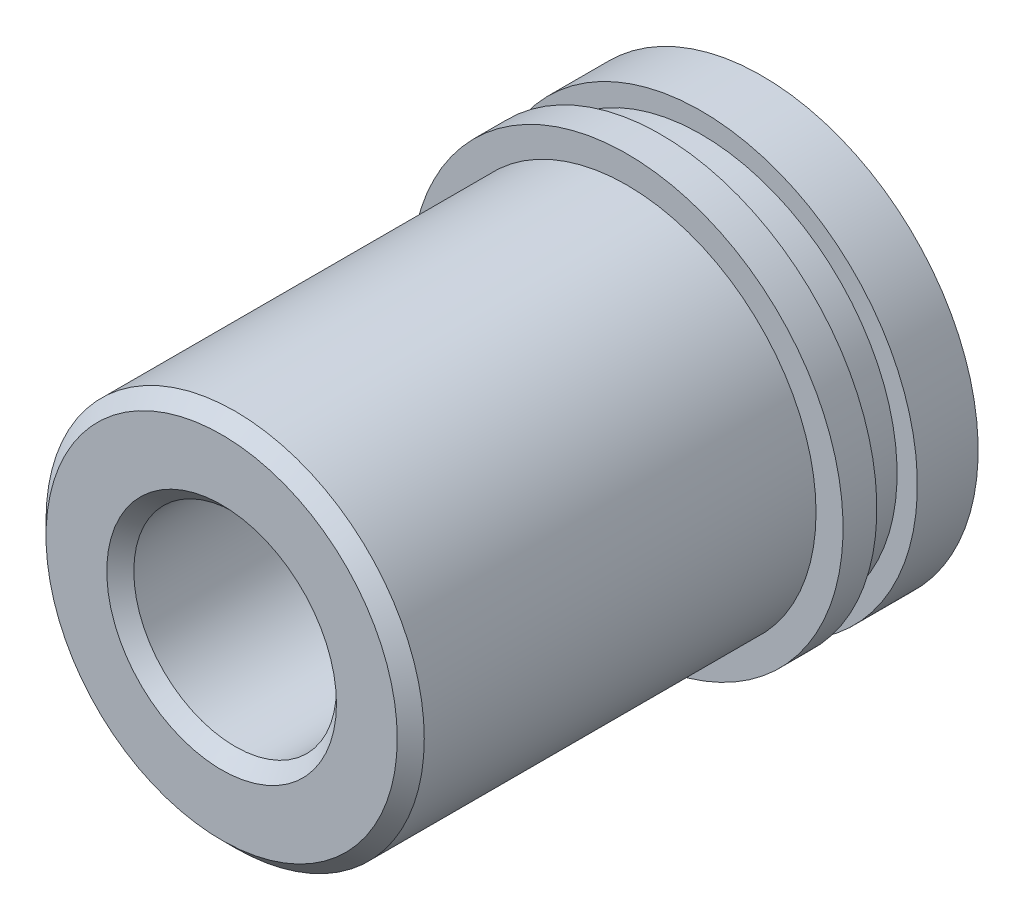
ISO-10303-21;
HEADER;
FILE_DESCRIPTION(('STEP AP214'),'2;1');
FILE_NAME('part.step','',(''),(''),'','','');
FILE_SCHEMA(('AUTOMOTIVE_DESIGN { 1 0 10303 214 1 1 1 1 }'));
ENDSEC;
DATA;
#1=APPLICATION_CONTEXT('core data for automotive mechanical design processes');
#2=APPLICATION_PROTOCOL_DEFINITION('international standard','automotive_design',2000,#1);
#3=PRODUCT_CONTEXT('',#1,'mechanical');
#4=PRODUCT('Part','Part','',(#3));
#5=PRODUCT_RELATED_PRODUCT_CATEGORY('part','',(#4));
#6=PRODUCT_DEFINITION_FORMATION('','',#4);
#7=PRODUCT_DEFINITION_CONTEXT('part definition',#1,'design');
#8=PRODUCT_DEFINITION('design','',#6,#7);
#9=PRODUCT_DEFINITION_SHAPE('','',#8);
#10=(LENGTH_UNIT() NAMED_UNIT(*) SI_UNIT(.MILLI.,.METRE.));
#11=(NAMED_UNIT(*) PLANE_ANGLE_UNIT() SI_UNIT($,.RADIAN.));
#12=(NAMED_UNIT(*) SI_UNIT($,.STERADIAN.) SOLID_ANGLE_UNIT());
#13=UNCERTAINTY_MEASURE_WITH_UNIT(LENGTH_MEASURE(1.E-05),#10,'distance_accuracy_value','');
#14=(GEOMETRIC_REPRESENTATION_CONTEXT(3) GLOBAL_UNCERTAINTY_ASSIGNED_CONTEXT((#13)) GLOBAL_UNIT_ASSIGNED_CONTEXT((#10,
#11,#12)) REPRESENTATION_CONTEXT('',''));
#15=CARTESIAN_POINT('',(0.,0.,0.));
#16=DIRECTION('',(0.,0.,1.));
#17=DIRECTION('',(1.,0.,0.));
#18=AXIS2_PLACEMENT_3D('',#15,#16,#17);
#19=CARTESIAN_POINT('',(0.,-4.71844785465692E-13,-19.9571428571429));
#20=DIRECTION('',(0.,0.,-1.));
#21=DIRECTION('',(-1.,0.,0.));
#22=AXIS2_PLACEMENT_3D('',#19,#20,#21);
#23=CYLINDRICAL_SURFACE('',#22,7.49999999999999);
#24=CARTESIAN_POINT('',(0.,0.,29.));
#25=DIRECTION('',(0.,0.,1.));
#26=DIRECTION('',(1.,0.,0.));
#27=AXIS2_PLACEMENT_3D('',#24,#25,#26);
#28=CIRCLE('',#27,7.49999999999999);
#29=CARTESIAN_POINT('',(7.49999999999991,0.,29.));
#30=VERTEX_POINT('',#29);
#31=EDGE_CURVE('E49',#30,#30,#28,.T.);
#32=ORIENTED_EDGE('',*,*,#31,.T.);
#33=EDGE_LOOP('',(#32));
#34=FACE_BOUND('',#33,.T.);
#35=CARTESIAN_POINT('',(0.,-4.71844785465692E-13,-8.99999999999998));
#36=DIRECTION('',(0.,0.,-1.));
#37=DIRECTION('',(-1.,0.,0.));
#38=AXIS2_PLACEMENT_3D('',#35,#36,#37);
#39=CIRCLE('',#38,7.49999999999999);
#40=CARTESIAN_POINT('',(-7.49999999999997,-5.01924890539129E-13,-8.99999999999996));
#41=VERTEX_POINT('',#40);
#42=EDGE_CURVE('E53',#41,#41,#39,.T.);
#43=ORIENTED_EDGE('',*,*,#42,.T.);
#44=EDGE_LOOP('',(#43));
#45=FACE_BOUND('',#44,.T.);
#46=ADVANCED_FACE('F39',(#34,#45),#23,.F.);
#47=CARTESIAN_POINT('',(-14.0000000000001,0.,30.));
#48=DIRECTION('',(0.,0.,1.));
#49=DIRECTION('',(1.,0.,0.));
#50=AXIS2_PLACEMENT_3D('',#47,#48,#49);
#51=PLANE('',#50);
#52=CARTESIAN_POINT('',(0.,0.,30.));
#53=DIRECTION('',(0.,0.,1.));
#54=DIRECTION('',(1.,0.,0.));
#55=AXIS2_PLACEMENT_3D('',#52,#53,#54);
#56=CIRCLE('',#55,8.5);
#57=CARTESIAN_POINT('',(8.49999999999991,0.,30.));
#58=VERTEX_POINT('',#57);
#59=EDGE_CURVE('E58',#58,#58,#56,.F.);
#60=ORIENTED_EDGE('',*,*,#59,.T.);
#61=EDGE_LOOP('',(#60));
#62=FACE_BOUND('',#61,.T.);
#63=CARTESIAN_POINT('',(0.,0.,30.));
#64=DIRECTION('',(0.,0.,1.));
#65=DIRECTION('',(1.,0.,0.));
#66=AXIS2_PLACEMENT_3D('',#63,#64,#65);
#67=CIRCLE('',#66,13.);
#68=CARTESIAN_POINT('',(12.9999999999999,0.,30.));
#69=VERTEX_POINT('',#68);
#70=EDGE_CURVE('E61',#69,#69,#67,.T.);
#71=ORIENTED_EDGE('',*,*,#70,.T.);
#72=EDGE_LOOP('',(#71));
#73=FACE_BOUND('',#72,.T.);
#74=ADVANCED_FACE('F103',(#62,#73),#51,.T.);
#75=CARTESIAN_POINT('',(0.,-4.71844785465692E-13,-19.9571428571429));
#76=DIRECTION('',(0.,0.,-1.));
#77=DIRECTION('',(-1.,0.,0.));
#78=AXIS2_PLACEMENT_3D('',#75,#76,#77);
#79=CYLINDRICAL_SURFACE('',#78,14.);
#80=CARTESIAN_POINT('',(0.,0.,29.));
#81=DIRECTION('',(0.,0.,1.));
#82=DIRECTION('',(1.,0.,0.));
#83=AXIS2_PLACEMENT_3D('',#80,#81,#82);
#84=CIRCLE('',#83,14.);
#85=CARTESIAN_POINT('',(13.9999999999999,0.,28.9999999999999));
#86=VERTEX_POINT('',#85);
#87=EDGE_CURVE('E10',#86,#86,#84,.F.);
#88=ORIENTED_EDGE('',*,*,#87,.T.);
#89=EDGE_LOOP('',(#88));
#90=FACE_BOUND('',#89,.T.);
#91=CARTESIAN_POINT('',(0.,0.,0.));
#92=DIRECTION('',(0.,0.,-1.));
#93=DIRECTION('',(-1.,0.,0.));
#94=AXIS2_PLACEMENT_3D('',#91,#92,#93);
#95=CIRCLE('',#94,14.);
#96=CARTESIAN_POINT('',(-14.,0.,0.));
#97=VERTEX_POINT('',#96);
#98=EDGE_CURVE('E64',#97,#97,#95,.T.);
#99=ORIENTED_EDGE('',*,*,#98,.F.);
#100=EDGE_LOOP('',(#99));
#101=FACE_BOUND('',#100,.T.);
#102=ADVANCED_FACE('F108',(#90,#101),#79,.T.);
#103=CARTESIAN_POINT('',(-16.,-4.71844785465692E-13,2.35922392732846E-13));
#104=DIRECTION('',(0.,0.,1.));
#105=DIRECTION('',(1.,0.,0.));
#106=AXIS2_PLACEMENT_3D('',#103,#104,#105);
#107=PLANE('',#106);
#108=ORIENTED_EDGE('',*,*,#98,.T.);
#109=EDGE_LOOP('',(#108));
#110=FACE_BOUND('',#109,.T.);
#111=CARTESIAN_POINT('',(0.,0.,0.));
#112=DIRECTION('',(0.,0.,-1.));
#113=DIRECTION('',(-1.,0.,0.));
#114=AXIS2_PLACEMENT_3D('',#111,#112,#113);
#115=CIRCLE('',#114,16.);
#116=CARTESIAN_POINT('',(-16.,0.,0.));
#117=VERTEX_POINT('',#116);
#118=EDGE_CURVE('E67',#117,#117,#115,.T.);
#119=ORIENTED_EDGE('',*,*,#118,.F.);
#120=EDGE_LOOP('',(#119));
#121=FACE_BOUND('',#120,.T.);
#122=ADVANCED_FACE('F178',(#110,#121),#107,.T.);
#123=CARTESIAN_POINT('',(0.,-4.71844785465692E-13,-19.9571428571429));
#124=DIRECTION('',(0.,0.,-1.));
#125=DIRECTION('',(-1.,0.,0.));
#126=AXIS2_PLACEMENT_3D('',#123,#124,#125);
#127=CYLINDRICAL_SURFACE('',#126,16.);
#128=ORIENTED_EDGE('',*,*,#118,.T.);
#129=EDGE_LOOP('',(#128));
#130=FACE_BOUND('',#129,.T.);
#131=CARTESIAN_POINT('',(0.,0.,-2.5));
#132=DIRECTION('',(0.,0.,-1.));
#133=DIRECTION('',(-1.,0.,0.));
#134=AXIS2_PLACEMENT_3D('',#131,#132,#133);
#135=CIRCLE('',#134,16.);
#136=CARTESIAN_POINT('',(-16.,0.,-2.49999999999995));
#137=VERTEX_POINT('',#136);
#138=EDGE_CURVE('E70',#137,#137,#135,.T.);
#139=ORIENTED_EDGE('',*,*,#138,.F.);
#140=EDGE_LOOP('',(#139));
#141=FACE_BOUND('',#140,.T.);
#142=ADVANCED_FACE('F168',(#130,#141),#127,.T.);
#143=CARTESIAN_POINT('',(-14.4999999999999,0.,-2.5));
#144=DIRECTION('',(0.,0.,-1.));
#145=DIRECTION('',(-1.,0.,0.));
#146=AXIS2_PLACEMENT_3D('',#143,#144,#145);
#147=PLANE('',#146);
#148=ORIENTED_EDGE('',*,*,#138,.T.);
#149=EDGE_LOOP('',(#148));
#150=FACE_BOUND('',#149,.T.);
#151=CARTESIAN_POINT('',(0.,0.,-2.5));
#152=DIRECTION('',(0.,0.,-1.));
#153=DIRECTION('',(-1.,0.,0.));
#154=AXIS2_PLACEMENT_3D('',#151,#152,#153);
#155=CIRCLE('',#154,14.5);
#156=CARTESIAN_POINT('',(-14.5,0.,-2.49999999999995));
#157=VERTEX_POINT('',#156);
#158=EDGE_CURVE('E73',#157,#157,#155,.T.);
#159=ORIENTED_EDGE('',*,*,#158,.F.);
#160=EDGE_LOOP('',(#159));
#161=FACE_BOUND('',#160,.T.);
#162=ADVANCED_FACE('F158',(#150,#161),#147,.T.);
#163=CARTESIAN_POINT('',(0.,-4.71844785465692E-13,-19.9571428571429));
#164=DIRECTION('',(0.,0.,-1.));
#165=DIRECTION('',(-1.,0.,0.));
#166=AXIS2_PLACEMENT_3D('',#163,#164,#165);
#167=CYLINDRICAL_SURFACE('',#166,14.5);
#168=ORIENTED_EDGE('',*,*,#158,.T.);
#169=EDGE_LOOP('',(#168));
#170=FACE_BOUND('',#169,.T.);
#171=CARTESIAN_POINT('',(0.,0.,-5.5));
#172=DIRECTION('',(0.,0.,-1.));
#173=DIRECTION('',(-1.,0.,0.));
#174=AXIS2_PLACEMENT_3D('',#171,#172,#173);
#175=CIRCLE('',#174,14.5);
#176=CARTESIAN_POINT('',(-14.5,0.,-5.49999999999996));
#177=VERTEX_POINT('',#176);
#178=EDGE_CURVE('E76',#177,#177,#175,.T.);
#179=ORIENTED_EDGE('',*,*,#178,.F.);
#180=EDGE_LOOP('',(#179));
#181=FACE_BOUND('',#180,.T.);
#182=ADVANCED_FACE('F99',(#170,#181),#167,.T.);
#183=CARTESIAN_POINT('',(-16.,-4.71844785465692E-13,-5.49999999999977));
#184=DIRECTION('',(0.,0.,1.));
#185=DIRECTION('',(1.,0.,0.));
#186=AXIS2_PLACEMENT_3D('',#183,#184,#185);
#187=PLANE('',#186);
#188=ORIENTED_EDGE('',*,*,#178,.T.);
#189=EDGE_LOOP('',(#188));
#190=FACE_BOUND('',#189,.T.);
#191=CARTESIAN_POINT('',(0.,0.,-5.5));
#192=DIRECTION('',(0.,0.,-1.));
#193=DIRECTION('',(-1.,0.,0.));
#194=AXIS2_PLACEMENT_3D('',#191,#192,#193);
#195=CIRCLE('',#194,16.);
#196=CARTESIAN_POINT('',(-16.,0.,-5.49999999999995));
#197=VERTEX_POINT('',#196);
#198=EDGE_CURVE('E79',#197,#197,#195,.T.);
#199=ORIENTED_EDGE('',*,*,#198,.F.);
#200=EDGE_LOOP('',(#199));
#201=FACE_BOUND('',#200,.T.);
#202=ADVANCED_FACE('F90',(#190,#201),#187,.T.);
#203=CARTESIAN_POINT('',(0.,-4.71844785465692E-13,-19.9571428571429));
#204=DIRECTION('',(0.,0.,-1.));
#205=DIRECTION('',(-1.,0.,0.));
#206=AXIS2_PLACEMENT_3D('',#203,#204,#205);
#207=CYLINDRICAL_SURFACE('',#206,16.);
#208=ORIENTED_EDGE('',*,*,#198,.T.);
#209=EDGE_LOOP('',(#208));
#210=FACE_BOUND('',#209,.T.);
#211=CARTESIAN_POINT('',(0.,-4.71844785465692E-13,-10.));
#212=DIRECTION('',(0.,0.,-1.));
#213=DIRECTION('',(-1.,0.,0.));
#214=AXIS2_PLACEMENT_3D('',#211,#212,#213);
#215=CIRCLE('',#214,16.);
#216=CARTESIAN_POINT('',(-16.,-5.36015676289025E-13,-9.99999999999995));
#217=VERTEX_POINT('',#216);
#218=EDGE_CURVE('E82',#217,#217,#215,.T.);
#219=ORIENTED_EDGE('',*,*,#218,.F.);
#220=EDGE_LOOP('',(#219));
#221=FACE_BOUND('',#220,.T.);
#222=ADVANCED_FACE('F88',(#210,#221),#207,.T.);
#223=CARTESIAN_POINT('',(-7.49999999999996,-4.71844785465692E-13,-10.));
#224=DIRECTION('',(0.,0.,-1.));
#225=DIRECTION('',(-1.,0.,0.));
#226=AXIS2_PLACEMENT_3D('',#223,#224,#225);
#227=PLANE('',#226);
#228=CARTESIAN_POINT('',(0.,-4.71844785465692E-13,-10.));
#229=DIRECTION('',(0.,0.,-1.));
#230=DIRECTION('',(-1.,0.,0.));
#231=AXIS2_PLACEMENT_3D('',#228,#229,#230);
#232=CIRCLE('',#231,8.5);
#233=CARTESIAN_POINT('',(-8.49999999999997,-5.05935571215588E-13,-9.99999999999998));
#234=VERTEX_POINT('',#233);
#235=EDGE_CURVE('E45',#234,#234,#232,.F.);
#236=ORIENTED_EDGE('',*,*,#235,.T.);
#237=EDGE_LOOP('',(#236));
#238=FACE_BOUND('',#237,.T.);
#239=ORIENTED_EDGE('',*,*,#218,.T.);
#240=EDGE_LOOP('',(#239));
#241=FACE_BOUND('',#240,.T.);
#242=ADVANCED_FACE('F86',(#238,#241),#227,.T.);
#243=CARTESIAN_POINT('',(0.,0.,30.));
#244=DIRECTION('',(0.,0.,1.));
#245=DIRECTION('',(1.,0.,0.));
#246=AXIS2_PLACEMENT_3D('',#243,#244,#245);
#247=CONICAL_SURFACE('',#246,8.5,0.785398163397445);
#248=ORIENTED_EDGE('',*,*,#31,.F.);
#249=EDGE_LOOP('',(#248));
#250=FACE_BOUND('',#249,.T.);
#251=ORIENTED_EDGE('',*,*,#59,.F.);
#252=EDGE_LOOP('',(#251));
#253=FACE_BOUND('',#252,.T.);
#254=ADVANCED_FACE('F97',(#250,#253),#247,.F.);
#255=CARTESIAN_POINT('',(0.,-4.71844785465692E-13,-8.99999999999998));
#256=DIRECTION('',(0.,0.,-1.));
#257=DIRECTION('',(-1.,0.,0.));
#258=AXIS2_PLACEMENT_3D('',#255,#256,#257);
#259=CONICAL_SURFACE('',#258,7.49999999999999,0.785398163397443);
#260=ORIENTED_EDGE('',*,*,#235,.F.);
#261=EDGE_LOOP('',(#260));
#262=FACE_BOUND('',#261,.T.);
#263=ORIENTED_EDGE('',*,*,#42,.F.);
#264=EDGE_LOOP('',(#263));
#265=FACE_BOUND('',#264,.T.);
#266=ADVANCED_FACE('F114',(#262,#265),#259,.F.);
#267=CARTESIAN_POINT('',(0.,0.,29.));
#268=DIRECTION('',(0.,0.,-1.));
#269=DIRECTION('',(-1.,0.,0.));
#270=AXIS2_PLACEMENT_3D('',#267,#268,#269);
#271=CONICAL_SURFACE('',#270,14.,0.785398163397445);
#272=ORIENTED_EDGE('',*,*,#70,.F.);
#273=EDGE_LOOP('',(#272));
#274=FACE_BOUND('',#273,.T.);
#275=ORIENTED_EDGE('',*,*,#87,.F.);
#276=EDGE_LOOP('',(#275));
#277=FACE_BOUND('',#276,.T.);
#278=ADVANCED_FACE('F116',(#274,#277),#271,.T.);
#279=CLOSED_SHELL('',(#46,#74,#102,#122,#142,#162,#182,#202,#222,#242,#254,#266,#278));
#280=MANIFOLD_SOLID_BREP('B2',#279);
#281=ADVANCED_BREP_SHAPE_REPRESENTATION('',(#18,#280),#14);
#282=SHAPE_DEFINITION_REPRESENTATION(#9,#281);
ENDSEC;
END-ISO-10303-21;
